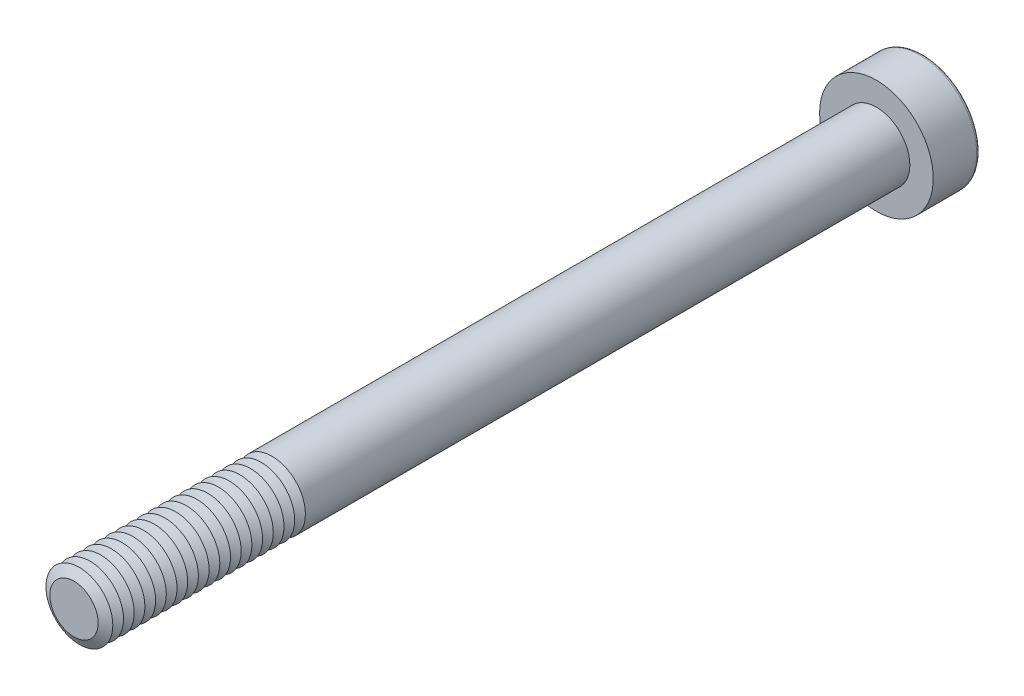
from build123d import *

# Parameters (mm, degrees)
SKETCH1_R           = 2.5
BOSS_EXTRUDE1_DEPTH = 60
SKETCH2_R           = 4.25
BOSS_EXTRUDE2_DEPTH = 3.5
CUT_EXTRUDE1_DEPTH  = 2.25
FILLET1_R           = 0.25
LPATTERN1_COUNT     = 19
LPATTERN1_PITCH     = 0.8


with BuildPart() as part:
    # Sketch1 → Boss-Extrude1 (new body)
    with BuildSketch(Plane.XY):
        Circle(SKETCH1_R)
    extrude(amount=BOSS_EXTRUDE1_DEPTH)

    # Sketch2 → Boss-Extrude2 (add)
    with BuildSketch(Plane(origin=(0, 0, 0), x_dir=(-1, 0, 0), z_dir=(0, 0, -1))):
        Circle(SKETCH2_R)
    extrude(amount=BOSS_EXTRUDE2_DEPTH)

    # Sketch3 → Cut-Extrude1 (cut)
    with BuildSketch(Plane(origin=(0, 0, -3.5), x_dir=(-1, 0, 0), z_dir=(0, 0, -1))):
        Polygon((-0.866025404, 1.5), (-1.732050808, 0), (-0.866025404, -1.5), (0.866025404, -1.5), (1.732050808, 0), (0.866025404, 1.5), align=None)
    extrude(amount=-CUT_EXTRUDE1_DEPTH, mode=Mode.SUBTRACT)

    # Fillet1
    fillet1_edges = [part.edges().sort_by_distance(p)[0] for p in [
        (4.25, 0, -3.5),
    ]]
    fillet(fillet1_edges, radius=FILLET1_R)

    # Cut-Extrude2 cone 1 section (on through the dimple's axis) → Cut-Extrude2 (revolve, cut)
    with BuildSketch(Plane(origin=(0, 0, -1.25), x_dir=(0, 1, 0), z_dir=(1, 0, 0))):
        Polygon((0, 0), (1.5, 0), (0, 0.866025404), align=None)
    revolve(axis=Axis((0, 0, -1.25), (0, 0, 1)), mode=Mode.SUBTRACT)

    # Cut-Extrude3 cone 1 section (on through the dimple's axis) → Cut-Extrude3 (revolve, cut)
    with BuildSketch(Plane(origin=(0, 0, -3.5), x_dir=(0, 1, 0), z_dir=(1, 0, 0))):
        Polygon((0, 0), (1.732050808, 0), (0, 0.464101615), align=None)
    revolve(axis=Axis((0, 0, -3.5), (0, 0, 1)), mode=Mode.SUBTRACT)

    # Sketch7 → Cut-Revolve1 (revolve, cut)
    with BuildSketch(Plane(origin=(0, 0, 0), x_dir=(0, 0, -1), z_dir=(1, 0, 0)), mode=Mode.PRIVATE) as cut_revolve1_sk:
        Polygon((-60, 1.807179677), (-59.6, 2.5), (-60.4, 2.5), align=None)
    cut_revolve1 = revolve(cut_revolve1_sk.sketch.rotate(Axis((0, 0, 60), (0, 0, -1)), 90), axis=Axis((0, 0, 60), (0, 0, -1)), mode=Mode.SUBTRACT)

    # LPattern1: Cut-Revolve1 ×19
    with Locations(*[(0, 0, -i * LPATTERN1_PITCH) for i in range(1, LPATTERN1_COUNT)]):
        add(cut_revolve1, mode=Mode.SUBTRACT)


solid = part.part
